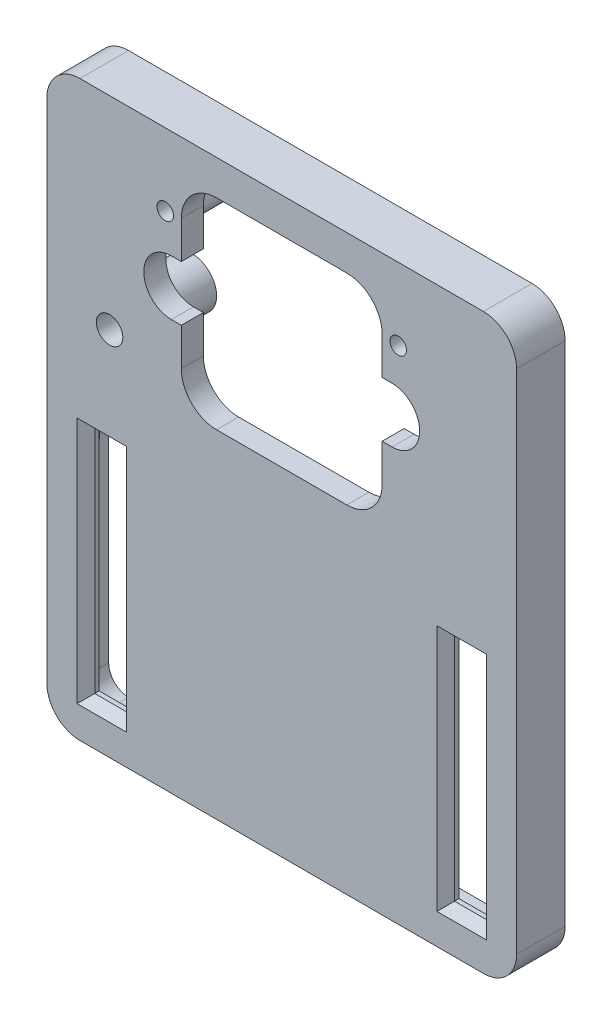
from build123d import *

# Parameters (mm, degrees)
CROQUIS1_R              = 1.2
CROQUIS1_R_2            = 0.75
CROQUIS1_W              = 2.88
CROQUIS1_H              = 20.82
SALIENTE_EXTRUIR1_DEPTH = 2
CHAFL_N1_SIZE           = 0.8
SALIENTE_EXTRUIR2_DEPTH = 2.4
CROQUIS3_R              = 1.34991
CROQUIS3_R_2            = 0.75
SALIENTE_EXTRUIR3_DEPTH = 6.5
SALIENTE_EXTRUIR4_START = -6.5
SALIENTE_EXTRUIR4_DEPTH = 6.5
CORTAR_EXTRUIR1_REACH   = 52.418
CROQUIS6_R              = 2.2
CROQUIS6_R_2            = 1.2
SALIENTE_EXTRUIR5_DEPTH = 5.5
CHAFL_N2_SIZE           = 1
CORTAR_EXTRUIR2_DEPTH   = 5
CORTAR_EXTRUIR3_DEPTH   = 5


with BuildPart() as part:
    # Croquis1 → Saliente-Extruir1 (new body)
    with BuildSketch(Plane.XY):
        with BuildLine():
            Line((-21.28, 22.975), (-21.28, -22.975))
            ThreePointArc((-21.28, -22.975), (-20.401320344, -25.096320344), (-18.28, -25.975))
            Line((-18.28, -25.975), (18.28, -25.975))
            ThreePointArc((18.28, -25.975), (20.401320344, -25.096320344), (21.28, -22.975))
            Line((21.28, -22.975), (21.28, 22.975))
            ThreePointArc((21.28, 22.975), (20.401320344, 25.096320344), (18.28, 25.975))
            Line((18.28, 25.975), (-18.28, 25.975))
            ThreePointArc((-18.28, 25.975), (-20.401320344, 25.096320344), (-21.28, 22.975))
        make_face()
        with Locations((-15.59858, 7.59861)):
            Circle(CROQUIS1_R, mode=Mode.SUBTRACT)
        with Locations((10.55699, 19.43509)):
            Circle(CROQUIS1_R_2, mode=Mode.SUBTRACT)
        with Locations(Location((-10.55699, 19.43509, 0), (0, 0, 180))):
            Circle(CROQUIS1_R_2, mode=Mode.SUBTRACT)
        with BuildLine():
            Line((10, 11.20192), (9.1, 11.20192))
            Line((9.1, 11.20192), (9.1, 7.80192))
            ThreePointArc((9.1, 7.80192), (8.1627417, 5.5391783), (5.9, 4.60192))
            Line((5.9, 4.60192), (-5.9, 4.60192))
            ThreePointArc((-5.9, 4.60192), (-8.1627417, 5.5391783), (-9.1, 7.80192))
            Line((-9.1, 7.80192), (-9.1, 11.20192))
            Line((-9.1, 11.20192), (-10, 11.20192))
            ThreePointArc((-10, 11.20192), (-12.5, 13.70192), (-10, 16.20192))
            Line((-10, 16.20192), (-9.1, 16.20192))
            Line((-9.1, 16.20192), (-9.1, 19.60192))
            ThreePointArc((-9.1, 19.60192), (-8.1627417, 21.8646617), (-5.9, 22.80192))
            Line((-5.9, 22.80192), (5.9, 22.80192))
            ThreePointArc((5.9, 22.80192), (8.1627417, 21.8646617), (9.1, 19.60192))
            Line((9.1, 19.60192), (9.1, 16.20192))
            Line((9.1, 16.20192), (10, 16.20192))
            ThreePointArc((10, 16.20192), (12.5, 13.70192), (10, 11.20192))
        make_face(mode=Mode.SUBTRACT)
        with Locations((16.3, -12)):
            Rectangle(CROQUIS1_W, CROQUIS1_H, mode=Mode.SUBTRACT)
        with Locations((-16.3, -12)):
            Rectangle(CROQUIS1_W, CROQUIS1_H, mode=Mode.SUBTRACT)
    extrude(amount=-SALIENTE_EXTRUIR1_DEPTH)

    # Chafl_n1
    chafl_n1_edges = [part.edges().sort_by_distance(p)[0] for p in [
        (-17.74, -12, -2),
        (-16.3, -1.59, -2),
        (-14.86, -12, -2),
        (-16.3, -22.41, -2),
        (-17.74, -12, 0),
        (-16.3, -22.41, 0),
        (-14.86, -12, 0),
        (-16.3, -1.59, 0),
        (17.74, -12, -2),
        (16.3, -22.41, -2),
        (14.86, -12, -2),
        (16.3, -1.59, -2),
        (17.74, -12, 0),
        (16.3, -1.59, 0),
        (14.86, -12, 0),
        (16.3, -22.41, 0),
    ]]
    chamfer(chafl_n1_edges, length=CHAFL_N1_SIZE)

    # Croquis2 → Saliente-Extruir2 (add)
    with BuildSketch(Plane(origin=(0, 0, -2), x_dir=(-1, 0, 0), z_dir=(0, 0, -1))):
        with BuildLine():
            Line((18.28, 25.975), (-18.28, 25.975))
            ThreePointArc((-18.28, 25.975), (-20.401320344, 25.096320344), (-21.28, 22.975))
            Line((-21.28, 22.975), (-21.28, -22.975))
            ThreePointArc((-21.28, -22.975), (-20.401320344, -25.096320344), (-18.28, -25.975))
            Line((-18.28, -25.975), (18.28, -25.975))
            ThreePointArc((18.28, -25.975), (20.401320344, -25.096320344), (21.28, -22.975))
            Line((21.28, -22.975), (21.28, 22.975))
            ThreePointArc((21.28, 22.975), (20.401320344, 25.096320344), (18.28, 25.975))
        make_face()
        with BuildLine():
            Line((18.28, 24.775), (-18.28, 24.775))
            ThreePointArc((-18.28, 24.775), (-19.552792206, 24.247792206), (-20.08, 22.975))
            Line((-20.08, 22.975), (-20.08, -22.975))
            ThreePointArc((-20.08, -22.975), (-19.552792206, -24.247792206), (-18.28, -24.775))
            Line((-18.28, -24.775), (18.28, -24.775))
            ThreePointArc((18.28, -24.775), (19.552792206, -24.247792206), (20.08, -22.975))
            Line((20.08, -22.975), (20.08, 22.975))
            ThreePointArc((20.08, 22.975), (19.552792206, 24.247792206), (18.28, 24.775))
        make_face(mode=Mode.SUBTRACT)
    extrude(amount=SALIENTE_EXTRUIR2_DEPTH)

    # Croquis3 → Saliente-Extruir3 (add)
    # profile 1 of 2: a face of its own
    with BuildSketch(Plane(origin=(0, 0, -2), x_dir=(-1, 0, 0), z_dir=(0, 0, -1))):
        with Locations(Location((10.55699, 19.43509, 0), (0, 0, 180))):
            Circle(CROQUIS3_R)
        with Locations((10.55699, 19.43509)):
            Circle(CROQUIS3_R_2, mode=Mode.SUBTRACT)
    # profile 2 of 2: a face of its own
    with BuildSketch(Plane(origin=(0, 0, -2), x_dir=(-1, 0, 0), z_dir=(0, 0, -1))):
        with Locations(Location((-10.55699, 19.43509, 0), (0, 0, 180))):
            Circle(CROQUIS3_R)
        with Locations(Location((-10.55699, 19.43509, 0), (0, 0, 180))):
            Circle(CROQUIS3_R_2, mode=Mode.SUBTRACT)
    extrude(amount=SALIENTE_EXTRUIR3_DEPTH)

    # Croquis4 → Saliente-Extruir4 (add)
    with BuildSketch(Plane(origin=(0, 0, -8.5), x_dir=(-1, 0, 0), z_dir=(0, 0, -1)).offset(SALIENTE_EXTRUIR4_START)):
        with BuildLine():
            Line((-11.810886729, 19.93509), (-17.274736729, 19.93509))
            Line((-17.274736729, 19.93509), (-17.274736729, 18.93509))
            Line((-17.274736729, 18.93509), (-11.810886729, 18.93509))
            ThreePointArc((-11.810886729, 18.93509), (-11.9069, 19.43509), (-11.810886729, 19.93509))
        make_face()
        with BuildLine():
            Line((11.810886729, 19.93509), (17.274736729, 19.93509))
            Line((17.274736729, 19.93509), (17.274736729, 18.93509))
            Line((17.274736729, 18.93509), (11.810886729, 18.93509))
            ThreePointArc((11.810886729, 18.93509), (11.9069, 19.43509), (11.810886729, 19.93509))
        make_face()
    extrude(amount=SALIENTE_EXTRUIR4_DEPTH)

    # Croquis5 → Cortar-Extruir1 (cut, up to next)
    with BuildSketch(Plane.XZ.offset(-18.93509), mode=Mode.PRIVATE) as cortar_extruir1_sk1:
        Polygon((12.274736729, -8.5), (17.274736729, -3.5), (17.274736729, -8.5), align=None)
    cortar_extruir1_tool1 = extrude(cortar_extruir1_sk1.sketch, amount=-CORTAR_EXTRUIR1_REACH, mode=Mode.PRIVATE) & part.part
    # Croquis5 → Cortar-Extruir1 (cut, up to next)
    with BuildSketch(Plane.XZ.offset(-18.93509), mode=Mode.PRIVATE) as cortar_extruir1_sk2:
        Polygon((-17.274736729, -3.5), (-17.274736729, -8.5), (-12.274736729, -8.5), align=None)
    cortar_extruir1_tool2 = extrude(cortar_extruir1_sk2.sketch, amount=-CORTAR_EXTRUIR1_REACH, mode=Mode.PRIVATE) & part.part
    add(cortar_extruir1_tool1.solids().sort_by_distance((15.60807, 18.93509, -6.833333))[0], mode=Mode.SUBTRACT)
    add(cortar_extruir1_tool2.solids().sort_by_distance((-15.60807, 18.93509, -6.833333))[0], mode=Mode.SUBTRACT)

    # Croquis6 → Saliente-Extruir5 (add)
    with BuildSketch(Plane(origin=(0, 0, -2), x_dir=(-1, 0, 0), z_dir=(0, 0, -1))):
        with Locations(Location((15.59858, 7.59861, 0), (0, 0, 180))):
            Circle(CROQUIS6_R)
        with Locations(Location((15.59858, 7.59861, 0), (0, 0, 180))):
            Circle(CROQUIS6_R_2, mode=Mode.SUBTRACT)
    extrude(amount=SALIENTE_EXTRUIR5_DEPTH)

    # Chafl_n2
    chafl_n2_edges = [part.edges().sort_by_distance(p)[0] for p in [
        (-17.79858, 7.59861, -2),
    ]]
    chamfer(chafl_n2_edges, length=CHAFL_N2_SIZE)

    # Croquis7 → Cortar-Extruir2 (cut, symmetric)
    with BuildSketch(Plane(origin=(0, 0, 0), x_dir=(0, 0, -1), z_dir=(1, 0, 0))):
        Polygon((2.42857, 24.775), (3.57143, 24.775), (3, 25.175), align=None)
        Polygon((2.42857, -24.775), (3.57143, -24.775), (3, -25.175), align=None)
    extrude(amount=CORTAR_EXTRUIR2_DEPTH, both=True, mode=Mode.SUBTRACT)

    # Croquis8 → Cortar-Extruir3 (cut, symmetric)
    with BuildSketch(Plane(origin=(0, 0, 0), x_dir=(1, 0, 0), z_dir=(0, 1, 0))):
        Polygon((20.08, 2.42857), (20.08, 3.56857), (20.48, 2.99857), align=None)
        Polygon((-20.48, 2.99857), (-20.08, 2.42857), (-20.08, 3.56857), align=None)
    extrude(amount=CORTAR_EXTRUIR3_DEPTH, both=True, mode=Mode.SUBTRACT)


solid = part.part
